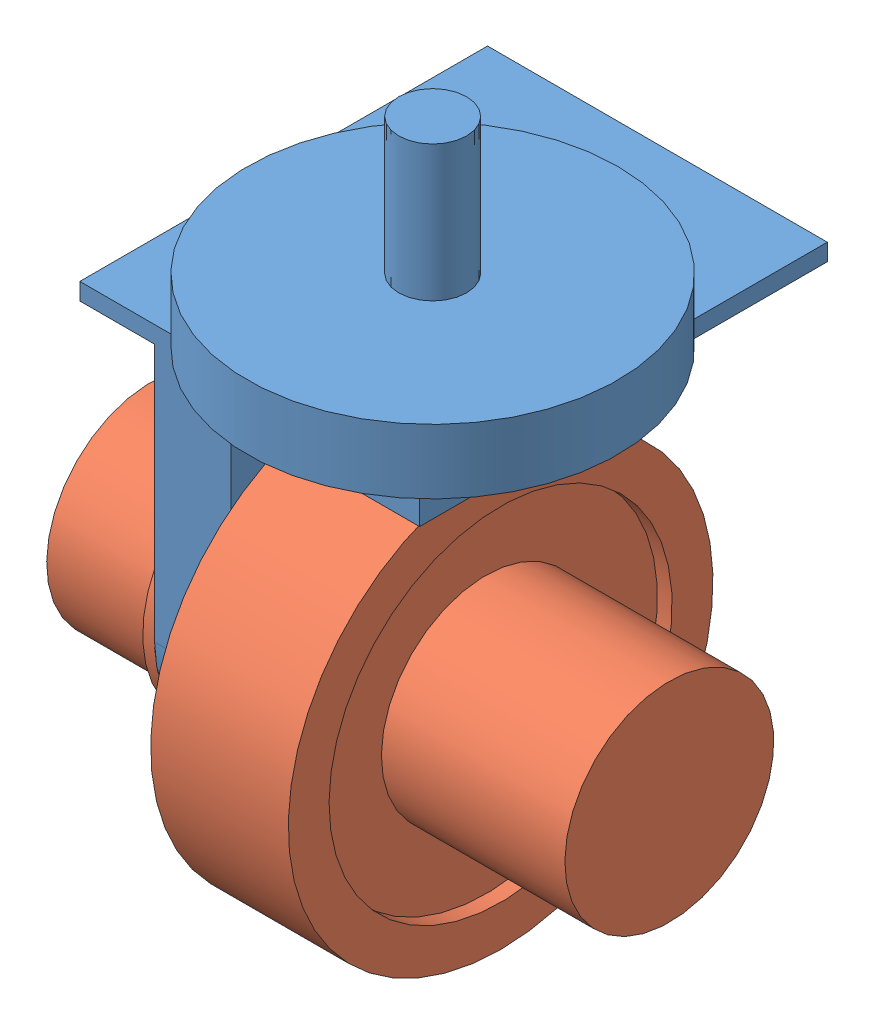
SolidWorks assembly frs240v2.SLDASM, configuration Default (file format 15000). Lengths in mm.
Overall size (305 436.07 326.27).
2 component instances, 2 part files, 2 mates.
Components (placement in the parent):
- steer_motor_support-1: steer_motor_support.SLDPRT [Default] at (-108.9481 -100.1432 380.3) size (246.7 349.8 279)
- traction_motor_wheel-1: traction_motor_wheel.SLDPRT [Default] at (-28.4481 -100.1432 380.3) x (-1 0 0) z (0 -0.294506 -0.95565) size (305 250 250)
Mates (geometry in assembly coordinates):
- Concentrico1: concentric anti-aligned: cylinder of steer_motor_support-1 through (-63.9481 -100.1432 380.3) axis (-1 0 0) radius 40; cylinder of traction_motor_wheel-1 through (1687.8762 -100.1432 380.3) axis (1 0 0) radius 40
- Larghezza1: width aligned: plane of traction_motor_wheel-1 through (-63.9481 -33.2477 359.6846) normal (-1 0 0); plane of traction_motor_wheel-1 through (-108.9481 -61.9172 368.5198) normal (1 0 0); plane of steer_motor_support-1 through (-108.9481 -100.1432 380.3) normal (-1 0 0); plane of steer_motor_support-1 through (-63.9481 -100.1432 380.3) normal (1 0 0)
